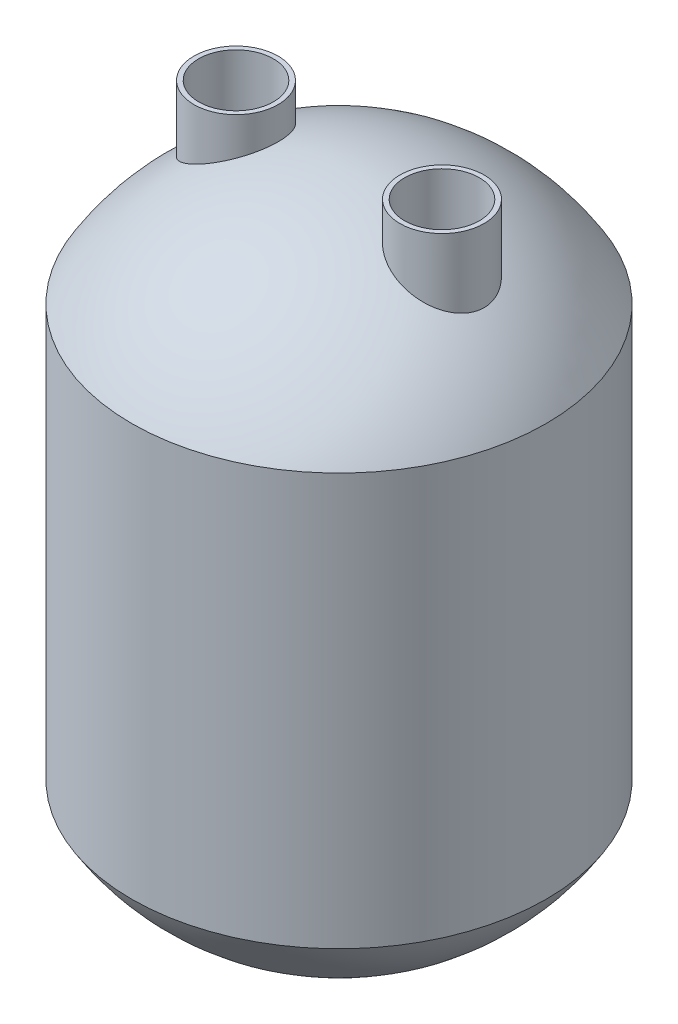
from build123d import *

# Parameters (mm, degrees)
CROQUIS2_R              = 12.7
CORTAR_EXTRUIR1_DEPTH   = 28
CROQUIS3_R              = 14.3
CROQUIS3_R_2            = 12.7
SALIENTE_EXTRUIR1_DEPTH = 30


with BuildPart() as part:
    # Croquis1 → Revoluci_n1 (revolve)
    with BuildSketch(Plane.XY):
        with BuildLine():
            Line((0, 161.699930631), (0, 157.699930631))
            ThreePointArc((0, 157.699930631), (38.046862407, 147.791312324), (66.427267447, 120.582911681))
            Line((66.427267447, 120.582911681), (66.427267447, -17.18305042))
            ThreePointArc((66.427267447, -17.18305042), (38.046862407, -44.391451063), (0, -54.300069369))
            Line((0, -54.300069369), (0, -58.300069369))
            ThreePointArc((0, -58.300069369), (40.496913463, -47.602243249), (70.427267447, -18.300069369))
            Line((70.427267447, -18.300069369), (70.427267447, 121.699930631))
            ThreePointArc((70.427267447, 121.699930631), (40.496913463, 151.00210451), (0, 161.699930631))
        make_face()
    revolve(axis=Axis((0, 161.699930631, 0), (0, -1, 0)))

    # Croquis2 → Cortar-Extruir1 (cut)
    with BuildSketch(Plane(origin=(0, 140, 0), x_dir=(-1, 0, 0), z_dir=(0, 1, 0))):
        with Locations((-35, 0)):
            Circle(CROQUIS2_R)
        with Locations(Location((35, 0, 0), (0, 0, 313.598963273))):
            Circle(CROQUIS2_R)
    extrude(amount=CORTAR_EXTRUIR1_DEPTH, mode=Mode.SUBTRACT)

    # Croquis3 → Saliente-Extruir1 (add)
    # profile 1 of 2: a face of its own
    with BuildSketch(Plane(origin=(0, 140, 0), x_dir=(-1, 0, 0), z_dir=(0, 1, 0))):
        with Locations(Location((-35, 0, 0), (0, 0, 313.946864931))):
            Circle(CROQUIS3_R)
        with Locations(Location((-35, 0, 0), (0, 0, 90))):
            Circle(CROQUIS3_R_2, mode=Mode.SUBTRACT)
    # profile 2 of 2: a face of its own
    with BuildSketch(Plane(origin=(0, 140, 0), x_dir=(-1, 0, 0), z_dir=(0, 1, 0))):
        with Locations(Location((35, 0, 0), (0, 0, 317.662447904))):
            Circle(CROQUIS3_R)
        with Locations(Location((35, 0, 0), (0, 0, 90))):
            Circle(CROQUIS3_R_2, mode=Mode.SUBTRACT)
    extrude(amount=SALIENTE_EXTRUIR1_DEPTH)


solid = part.part
